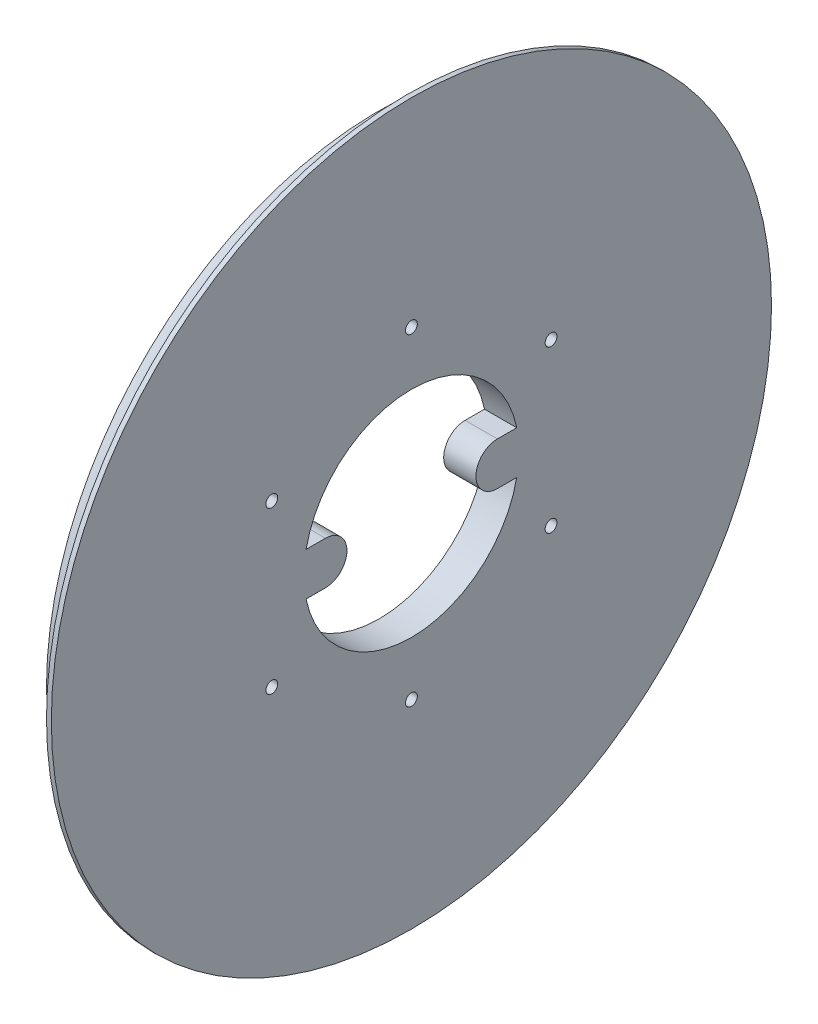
from build123d import *

# Parameters (mm, degrees)
ESQUISSE5_R             = 1.1
ENL_V_MAT_EXTRU_1_DEPTH = 6


with BuildPart() as part:
    # Esquisse3 → R_volution1 (revolve)
    with BuildSketch(Plane.XY, mode=Mode.PRIVATE) as r_volution1_sk:
        with BuildLine():
            Line((6, 61.9), (6, 0))
            Line((6, 0), (12, 0))
            Line((12, 0), (12, 67))
            Line((12, 67), (11.1, 67))
            ThreePointArc((11.1, 67), (9.606244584, 63.393755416), (6, 61.9))
        make_face()
    revolve(r_volution1_sk.sketch.rotate(Axis((-19.078214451, 0, 0), (1, 0, 0)), 90), axis=Axis((-19.078214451, 0, 0), (1, 0, 0)))

    # Esquisse5 → Enl_v. mat.-Extru.1 (cut)
    with BuildSketch(Plane.ZY.offset(-6)):
        with Locations((0, 30)):
            Circle(ESQUISSE5_R)
        with Locations((25.980762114, 15)):
            Circle(ESQUISSE5_R)
        with Locations((25.980762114, -15)):
            Circle(ESQUISSE5_R)
        with Locations((0, -30)):
            Circle(ESQUISSE5_R)
        with Locations((-25.980762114, -15)):
            Circle(ESQUISSE5_R)
        with Locations((-25.980762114, 15)):
            Circle(ESQUISSE5_R)
        with BuildLine():
            Line((-19.595917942, 4), (-16, 4))
            ThreePointArc((-16, 4), (-12, 0), (-16, -4))
            Line((-16, -4), (-19.595917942, -4))
            ThreePointArc((-19.595917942, -4), (0, -20), (19.595917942, -4))
            Line((19.595917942, -4), (16, -4))
            ThreePointArc((16, -4), (12, 0), (16, 4))
            Line((16, 4), (19.595917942, 4))
            ThreePointArc((19.595917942, 4), (0, 20), (-19.595917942, 4))
        make_face()
    extrude(amount=-ENL_V_MAT_EXTRU_1_DEPTH, mode=Mode.SUBTRACT)


solid = part.part
